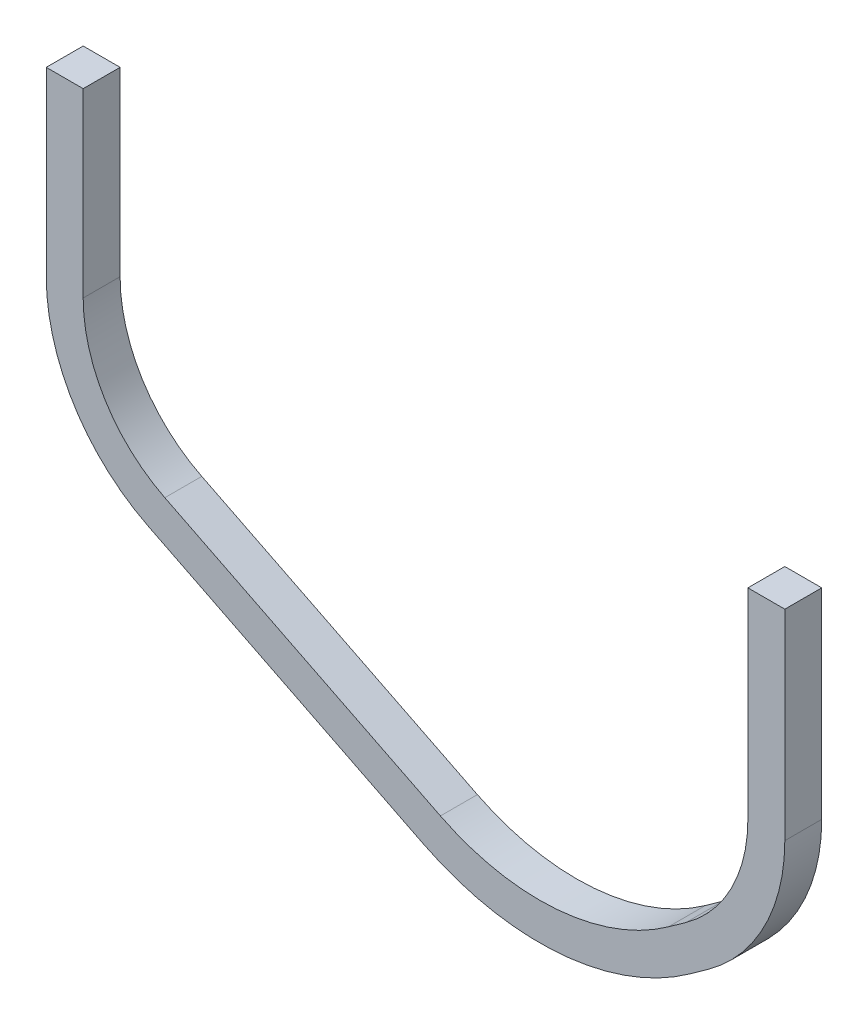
from build123d import *

# Parameters (mm, degrees)
EXTRUSION1_DEPTH = 0.25
CONG_1_R         = 2
CONG_2_R         = 2.5
CONG_3_R         = 2.5
CONG_4_R         = 2
CONG_7_R         = 3
CONG_8_R         = 3.5


with BuildPart() as part:
    # Esquisse1 → Extrusion1 (new, symmetric)
    with BuildSketch(Plane.XY):
        Polygon((-10, 4.000000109), (-10, 1.09e-07), (-3, -3.5), (0, -1.3533925), (0, 2.6466075), (-0.5, 2.6466075), (-0.5, -1.09634509), (-3.0459043, -2.91803085), (-9.5, 0.309017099), (-9.5, 4.000000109), align=None)
    extrude(amount=EXTRUSION1_DEPTH, both=True)

    # Cong_1
    cong_1_edges = [part.edges().sort_by_distance(p)[0] for p in [
        (-9.5, 0.309017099, 0),
    ]]
    fillet(cong_1_edges, radius=CONG_1_R)

    # Cong_2
    cong_2_edges = [part.edges().sort_by_distance(p)[0] for p in [
        (-10, 1.09e-07, 0),
    ]]
    fillet(cong_2_edges, radius=CONG_2_R)

    # Cong_3
    cong_3_edges = [part.edges().sort_by_distance(p)[0] for p in [
        (0, -1.3533925, 0),
    ]]
    fillet(cong_3_edges, radius=CONG_3_R)

    # Cong_4
    cong_4_edges = [part.edges().sort_by_distance(p)[0] for p in [
        (-0.5, -1.09634509, 0),
    ]]
    fillet(cong_4_edges, radius=CONG_4_R)

    # Cong_7
    cong_7_edges = [part.edges().sort_by_distance(p)[0] for p in [
        (-3.0459043, -2.91803085, 0),
    ]]
    fillet(cong_7_edges, radius=CONG_7_R)

    # Cong_8
    cong_8_edges = [part.edges().sort_by_distance(p)[0] for p in [
        (-3, -3.5, 0),
    ]]
    fillet(cong_8_edges, radius=CONG_8_R)


solid = part.part
